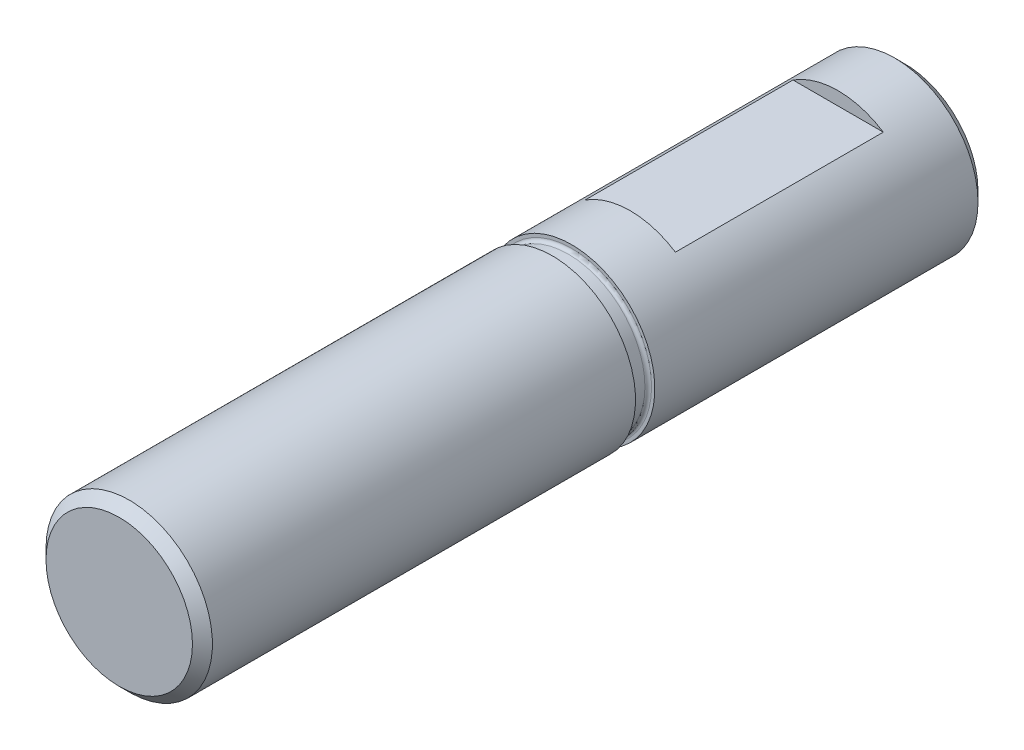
ISO-10303-21;
HEADER;
FILE_DESCRIPTION(('STEP AP214'),'2;1');
FILE_NAME('part.step','',(''),(''),'','','');
FILE_SCHEMA(('AUTOMOTIVE_DESIGN { 1 0 10303 214 1 1 1 1 }'));
ENDSEC;
DATA;
#1=APPLICATION_CONTEXT('core data for automotive mechanical design processes');
#2=APPLICATION_PROTOCOL_DEFINITION('international standard','automotive_design',2000,#1);
#3=PRODUCT_CONTEXT('',#1,'mechanical');
#4=PRODUCT('Part','Part','',(#3));
#5=PRODUCT_RELATED_PRODUCT_CATEGORY('part','',(#4));
#6=PRODUCT_DEFINITION_FORMATION('','',#4);
#7=PRODUCT_DEFINITION_CONTEXT('part definition',#1,'design');
#8=PRODUCT_DEFINITION('design','',#6,#7);
#9=PRODUCT_DEFINITION_SHAPE('','',#8);
#10=(LENGTH_UNIT() NAMED_UNIT(*) SI_UNIT(.MILLI.,.METRE.));
#11=(NAMED_UNIT(*) PLANE_ANGLE_UNIT() SI_UNIT($,.RADIAN.));
#12=(NAMED_UNIT(*) SI_UNIT($,.STERADIAN.) SOLID_ANGLE_UNIT());
#13=UNCERTAINTY_MEASURE_WITH_UNIT(LENGTH_MEASURE(1.E-05),#10,'distance_accuracy_value','');
#14=(GEOMETRIC_REPRESENTATION_CONTEXT(3) GLOBAL_UNCERTAINTY_ASSIGNED_CONTEXT((#13)) GLOBAL_UNIT_ASSIGNED_CONTEXT((#10,
#11,#12)) REPRESENTATION_CONTEXT('',''));
#15=CARTESIAN_POINT('',(0.,0.,0.));
#16=DIRECTION('',(0.,0.,1.));
#17=DIRECTION('',(1.,0.,0.));
#18=AXIS2_PLACEMENT_3D('',#15,#16,#17);
#19=CARTESIAN_POINT('',(0.,0.,29.9466));
#20=DIRECTION('',(0.,0.,-1.));
#21=DIRECTION('',(-1.,0.,0.));
#22=AXIS2_PLACEMENT_3D('',#19,#20,#21);
#23=CYLINDRICAL_SURFACE('',#22,3.17246);
#24=CARTESIAN_POINT('',(0.,0.,29.5656));
#25=DIRECTION('',(0.,0.,1.));
#26=DIRECTION('',(1.,0.,0.));
#27=AXIS2_PLACEMENT_3D('',#24,#25,#26);
#28=CIRCLE('',#27,3.17246);
#29=CARTESIAN_POINT('',(-3.17246,0.,29.5656));
#30=VERTEX_POINT('',#29);
#31=EDGE_CURVE('E83',#30,#30,#28,.F.);
#32=CARTESIAN_POINT('',(0.,0.,13.4366));
#33=DIRECTION('',(0.,0.,-1.));
#34=DIRECTION('',(-1.,0.,0.));
#35=AXIS2_PLACEMENT_3D('',#32,#33,#34);
#36=CIRCLE('',#35,3.17246);
#37=CARTESIAN_POINT('',(-3.17246,0.,13.4366));
#38=VERTEX_POINT('',#37);
#39=EDGE_CURVE('E149',#38,#38,#36,.T.);
#40=CARTESIAN_POINT('',(-3.17246,0.,29.5656));
#41=CARTESIAN_POINT('',(-3.17246,0.,29.3975895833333));
#42=CARTESIAN_POINT('',(-3.17246,0.,29.2295791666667));
#43=CARTESIAN_POINT('',(-3.17246,0.,28.8935583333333));
#44=CARTESIAN_POINT('',(-3.17246,0.,28.7255479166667));
#45=CARTESIAN_POINT('',(-3.17246,0.,28.3895270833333));
#46=CARTESIAN_POINT('',(-3.17246,0.,28.2215166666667));
#47=CARTESIAN_POINT('',(-3.17246,0.,27.8854958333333));
#48=CARTESIAN_POINT('',(-3.17246,0.,27.7174854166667));
#49=CARTESIAN_POINT('',(-3.17246,0.,27.3814645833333));
#50=CARTESIAN_POINT('',(-3.17246,0.,27.2134541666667));
#51=CARTESIAN_POINT('',(-3.17246,0.,26.8774333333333));
#52=CARTESIAN_POINT('',(-3.17246,0.,26.7094229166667));
#53=CARTESIAN_POINT('',(-3.17246,0.,26.3734020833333));
#54=CARTESIAN_POINT('',(-3.17246,0.,26.2053916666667));
#55=CARTESIAN_POINT('',(-3.17246,0.,25.8693708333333));
#56=CARTESIAN_POINT('',(-3.17246,0.,25.7013604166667));
#57=CARTESIAN_POINT('',(-3.17246,0.,25.3653395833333));
#58=CARTESIAN_POINT('',(-3.17246,0.,25.1973291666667));
#59=CARTESIAN_POINT('',(-3.17246,0.,24.8613083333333));
#60=CARTESIAN_POINT('',(-3.17246,0.,24.6932979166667));
#61=CARTESIAN_POINT('',(-3.17246,0.,24.3572770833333));
#62=CARTESIAN_POINT('',(-3.17246,0.,24.1892666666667));
#63=CARTESIAN_POINT('',(-3.17246,0.,23.8532458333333));
#64=CARTESIAN_POINT('',(-3.17246,0.,23.6852354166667));
#65=CARTESIAN_POINT('',(-3.17246,0.,23.3492145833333));
#66=CARTESIAN_POINT('',(-3.17246,0.,23.1812041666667));
#67=CARTESIAN_POINT('',(-3.17246,0.,22.8451833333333));
#68=CARTESIAN_POINT('',(-3.17246,0.,22.6771729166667));
#69=CARTESIAN_POINT('',(-3.17246,0.,22.3411520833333));
#70=CARTESIAN_POINT('',(-3.17246,0.,22.1731416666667));
#71=CARTESIAN_POINT('',(-3.17246,0.,21.8371208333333));
#72=CARTESIAN_POINT('',(-3.17246,0.,21.6691104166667));
#73=CARTESIAN_POINT('',(-3.17246,0.,21.3330895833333));
#74=CARTESIAN_POINT('',(-3.17246,0.,21.1650791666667));
#75=CARTESIAN_POINT('',(-3.17246,0.,20.8290583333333));
#76=CARTESIAN_POINT('',(-3.17246,0.,20.6610479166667));
#77=CARTESIAN_POINT('',(-3.17246,0.,20.3250270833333));
#78=CARTESIAN_POINT('',(-3.17246,0.,20.1570166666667));
#79=CARTESIAN_POINT('',(-3.17246,0.,19.8209958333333));
#80=CARTESIAN_POINT('',(-3.17246,0.,19.6529854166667));
#81=CARTESIAN_POINT('',(-3.17246,0.,19.3169645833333));
#82=CARTESIAN_POINT('',(-3.17246,0.,19.1489541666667));
#83=CARTESIAN_POINT('',(-3.17246,0.,18.8129333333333));
#84=CARTESIAN_POINT('',(-3.17246,0.,18.6449229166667));
#85=CARTESIAN_POINT('',(-3.17246,0.,18.3089020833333));
#86=CARTESIAN_POINT('',(-3.17246,0.,18.1408916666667));
#87=CARTESIAN_POINT('',(-3.17246,0.,17.8048708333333));
#88=CARTESIAN_POINT('',(-3.17246,0.,17.6368604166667));
#89=CARTESIAN_POINT('',(-3.17246,0.,17.3008395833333));
#90=CARTESIAN_POINT('',(-3.17246,0.,17.1328291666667));
#91=CARTESIAN_POINT('',(-3.17246,0.,16.7968083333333));
#92=CARTESIAN_POINT('',(-3.17246,0.,16.6287979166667));
#93=CARTESIAN_POINT('',(-3.17246,0.,16.2927770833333));
#94=CARTESIAN_POINT('',(-3.17246,0.,16.1247666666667));
#95=CARTESIAN_POINT('',(-3.17246,0.,15.7887458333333));
#96=CARTESIAN_POINT('',(-3.17246,0.,15.6207354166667));
#97=CARTESIAN_POINT('',(-3.17246,0.,15.2847145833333));
#98=CARTESIAN_POINT('',(-3.17246,0.,15.1167041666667));
#99=CARTESIAN_POINT('',(-3.17246,0.,14.7806833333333));
#100=CARTESIAN_POINT('',(-3.17246,0.,14.6126729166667));
#101=CARTESIAN_POINT('',(-3.17246,0.,14.2766520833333));
#102=CARTESIAN_POINT('',(-3.17246,0.,14.1086416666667));
#103=CARTESIAN_POINT('',(-3.17246,0.,13.7726208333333));
#104=CARTESIAN_POINT('',(-3.17246,0.,13.6046104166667));
#105=CARTESIAN_POINT('',(-3.17246,0.,13.4366));
#106=B_SPLINE_CURVE_WITH_KNOTS('',3,(#40,#41,#42,#43,#44,#45,#46,#47,#48,#49,#50,#51,#52,#53,
#54,#55,#56,#57,#58,#59,#60,#61,#62,#63,#64,#65,#66,#67,#68,#69,#70,#71,#72,#73,#74,#75,#76,#77,
#78,#79,#80,#81,#82,#83,#84,#85,#86,#87,#88,#89,#90,#91,#92,#93,#94,#95,#96,#97,#98,#99,#100,
#101,#102,#103,#104,#105),.UNSPECIFIED.,.F.,.F.,(4,2,2,2,2,2,2,2,2,2,2,2,2,2,2,2,2,2,2,2,2,2,2,
2,2,2,2,2,2,2,2,2,4),(0.,0.504031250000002,1.0080625,1.51209375,2.016125,2.52015625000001,
3.0241875,3.52821875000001,4.03225,4.53628125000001,5.04031250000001,5.54434375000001,
6.04837500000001,6.55240625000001,7.05643750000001,7.56046875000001,8.06450000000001,
8.56853125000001,9.07256250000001,9.57659375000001,10.080625,10.58465625,11.0886875,11.59271875,
12.09675,12.60078125,13.1048125,13.60884375,14.112875,14.61690625,15.1209375,15.62496875,
16.129),.UNSPECIFIED.);
#107=EDGE_CURVE('BSEAM33',#30,#38,#106,.T.);
#108=ORIENTED_EDGE('',*,*,#31,.T.);
#109=ORIENTED_EDGE('',*,*,#39,.F.);
#110=ORIENTED_EDGE('',*,*,#107,.T.);
#111=ORIENTED_EDGE('',*,*,#107,.F.);
#112=EDGE_LOOP('',(#108,#110,#109,#111));
#113=FACE_BOUND('',#112,.T.);
#114=ADVANCED_FACE('F33',(#113),#23,.T.);
#115=CARTESIAN_POINT('',(0.,0.,29.9466));
#116=DIRECTION('',(0.,0.,1.));
#117=DIRECTION('',(1.,0.,0.));
#118=AXIS2_PLACEMENT_3D('',#115,#116,#117);
#119=PLANE('',#118);
#120=CARTESIAN_POINT('',(0.,0.,29.9466));
#121=DIRECTION('',(0.,0.,1.));
#122=DIRECTION('',(1.,0.,0.));
#123=AXIS2_PLACEMENT_3D('',#120,#121,#122);
#124=CIRCLE('',#123,2.79146000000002);
#125=CARTESIAN_POINT('',(2.79146000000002,0.,29.9466));
#126=VERTEX_POINT('',#125);
#127=EDGE_CURVE('E80',#126,#126,#124,.T.);
#128=ORIENTED_EDGE('',*,*,#127,.T.);
#129=EDGE_LOOP('',(#128));
#130=FACE_BOUND('',#129,.T.);
#131=ADVANCED_FACE('F98',(#130),#119,.T.);
#132=CARTESIAN_POINT('',(3.17246,0.,13.4366));
#133=DIRECTION('',(0.,0.,-1.));
#134=DIRECTION('',(-1.,0.,0.));
#135=AXIS2_PLACEMENT_3D('',#132,#133,#134);
#136=PLANE('',#135);
#137=CARTESIAN_POINT('',(0.,0.,13.4366));
#138=DIRECTION('',(0.,0.,-1.));
#139=DIRECTION('',(-1.,0.,0.));
#140=AXIS2_PLACEMENT_3D('',#137,#138,#139);
#141=CIRCLE('',#140,3.048);
#142=CARTESIAN_POINT('',(-3.048,0.,13.4366));
#143=VERTEX_POINT('',#142);
#144=EDGE_CURVE('E65',#143,#143,#141,.F.);
#145=ORIENTED_EDGE('',*,*,#144,.T.);
#146=EDGE_LOOP('',(#145));
#147=FACE_BOUND('',#146,.T.);
#148=ORIENTED_EDGE('',*,*,#39,.T.);
#149=EDGE_LOOP('',(#148));
#150=FACE_BOUND('',#149,.T.);
#151=ADVANCED_FACE('F104',(#147,#150),#136,.T.);
#152=CARTESIAN_POINT('',(0.,0.,0.));
#153=DIRECTION('',(0.,0.,-1.));
#154=DIRECTION('',(-1.,0.,0.));
#155=AXIS2_PLACEMENT_3D('',#152,#153,#154);
#156=CYLINDRICAL_SURFACE('',#155,2.921);
#157=CARTESIAN_POINT('',(0.,0.,12.827));
#158=DIRECTION('',(0.,0.,1.));
#159=DIRECTION('',(1.,0.,0.));
#160=AXIS2_PLACEMENT_3D('',#157,#158,#159);
#161=CIRCLE('',#160,2.921);
#162=CARTESIAN_POINT('',(2.921,0.,12.827));
#163=VERTEX_POINT('',#162);
#164=EDGE_CURVE('E160',#163,#163,#161,.T.);
#165=ORIENTED_EDGE('',*,*,#164,.T.);
#166=EDGE_LOOP('',(#165));
#167=FACE_BOUND('',#166,.T.);
#168=CARTESIAN_POINT('',(0.,0.,13.3096));
#169=DIRECTION('',(0.,0.,-1.));
#170=DIRECTION('',(-1.,0.,0.));
#171=AXIS2_PLACEMENT_3D('',#168,#169,#170);
#172=CIRCLE('',#171,2.921);
#173=CARTESIAN_POINT('',(-2.921,0.,13.3096));
#174=VERTEX_POINT('',#173);
#175=EDGE_CURVE('E157',#174,#174,#172,.T.);
#176=ORIENTED_EDGE('',*,*,#175,.T.);
#177=EDGE_LOOP('',(#176));
#178=FACE_BOUND('',#177,.T.);
#179=ADVANCED_FACE('F124',(#167,#178),#156,.T.);
#180=CARTESIAN_POINT('',(3.17246,0.,12.7));
#181=DIRECTION('',(0.,0.,1.));
#182=DIRECTION('',(1.,0.,0.));
#183=AXIS2_PLACEMENT_3D('',#180,#181,#182);
#184=PLANE('',#183);
#185=CARTESIAN_POINT('',(0.,0.,12.7));
#186=DIRECTION('',(0.,0.,1.));
#187=DIRECTION('',(1.,0.,0.));
#188=AXIS2_PLACEMENT_3D('',#185,#186,#187);
#189=CIRCLE('',#188,3.048);
#190=CARTESIAN_POINT('',(3.048,0.,12.7));
#191=VERTEX_POINT('',#190);
#192=EDGE_CURVE('E154',#191,#191,#189,.F.);
#193=ORIENTED_EDGE('',*,*,#192,.T.);
#194=EDGE_LOOP('',(#193));
#195=FACE_BOUND('',#194,.T.);
#196=CARTESIAN_POINT('',(0.,0.,12.7));
#197=DIRECTION('',(0.,0.,-1.));
#198=DIRECTION('',(-1.,0.,0.));
#199=AXIS2_PLACEMENT_3D('',#196,#197,#198);
#200=CIRCLE('',#199,3.17246);
#201=CARTESIAN_POINT('',(-3.17246,0.,12.7));
#202=VERTEX_POINT('',#201);
#203=EDGE_CURVE('E146',#202,#202,#200,.T.);
#204=ORIENTED_EDGE('',*,*,#203,.F.);
#205=EDGE_LOOP('',(#204));
#206=FACE_BOUND('',#205,.T.);
#207=ADVANCED_FACE('F119',(#195,#206),#184,.T.);
#208=CARTESIAN_POINT('',(0.,0.,0.));
#209=DIRECTION('',(0.,0.,1.));
#210=DIRECTION('',(1.,0.,0.));
#211=AXIS2_PLACEMENT_3D('',#208,#209,#210);
#212=PLANE('',#211);
#213=CARTESIAN_POINT('',(0.,0.,0.));
#214=DIRECTION('',(0.,0.,1.));
#215=DIRECTION('',(1.,0.,0.));
#216=AXIS2_PLACEMENT_3D('',#213,#214,#215);
#217=CIRCLE('',#216,2.79145999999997);
#218=CARTESIAN_POINT('',(2.79145999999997,0.,0.));
#219=VERTEX_POINT('',#218);
#220=EDGE_CURVE('E11',#219,#219,#217,.F.);
#221=ORIENTED_EDGE('',*,*,#220,.T.);
#222=EDGE_LOOP('',(#221));
#223=FACE_BOUND('',#222,.T.);
#224=ADVANCED_FACE('F112',(#223),#212,.F.);
#225=CARTESIAN_POINT('',(0.,0.,0.381000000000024));
#226=DIRECTION('',(0.,0.,1.));
#227=DIRECTION('',(1.,0.,0.));
#228=AXIS2_PLACEMENT_3D('',#225,#226,#227);
#229=CIRCLE('',#228,3.17246);
#230=CARTESIAN_POINT('',(3.17246,0.,0.381000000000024));
#231=VERTEX_POINT('',#230);
#232=EDGE_CURVE('E41',#231,#231,#229,.T.);
#233=ORIENTED_EDGE('',*,*,#232,.T.);
#234=EDGE_LOOP('',(#233));
#235=FACE_BOUND('',#234,.T.);
#236=DIRECTION('',(0.,0.,-1.));
#237=VECTOR('',#236,1.);
#238=CARTESIAN_POINT('',(-1.72196264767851,2.66446,29.9466));
#239=LINE('',#238,#237);
#240=CARTESIAN_POINT('',(-1.72196264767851,2.66446,10.4648));
#241=VERTEX_POINT('',#240);
#242=CARTESIAN_POINT('',(-1.72196264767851,2.66446,2.54));
#243=VERTEX_POINT('',#242);
#244=EDGE_CURVE('E68',#241,#243,#239,.T.);
#245=ORIENTED_EDGE('',*,*,#244,.T.);
#246=CARTESIAN_POINT('',(0.,0.,2.54));
#247=DIRECTION('',(0.,0.,-1.));
#248=DIRECTION('',(-1.,0.,0.));
#249=AXIS2_PLACEMENT_3D('',#246,#247,#248);
#250=CIRCLE('',#249,3.17246);
#251=CARTESIAN_POINT('',(1.72196264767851,2.66446,2.54));
#252=VERTEX_POINT('',#251);
#253=EDGE_CURVE('E74',#243,#252,#250,.T.);
#254=ORIENTED_EDGE('',*,*,#253,.T.);
#255=DIRECTION('',(0.,0.,-1.));
#256=VECTOR('',#255,1.);
#257=CARTESIAN_POINT('',(1.72196264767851,2.66446,29.9466));
#258=LINE('',#257,#256);
#259=CARTESIAN_POINT('',(1.72196264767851,2.66446,10.4648));
#260=VERTEX_POINT('',#259);
#261=EDGE_CURVE('E54',#252,#260,#258,.F.);
#262=ORIENTED_EDGE('',*,*,#261,.T.);
#263=CARTESIAN_POINT('',(0.,0.,10.4648));
#264=DIRECTION('',(0.,0.,1.));
#265=DIRECTION('',(1.,0.,0.));
#266=AXIS2_PLACEMENT_3D('',#263,#264,#265);
#267=CIRCLE('',#266,3.17246);
#268=EDGE_CURVE('E61',#260,#241,#267,.T.);
#269=ORIENTED_EDGE('',*,*,#268,.T.);
#270=EDGE_LOOP('',(#245,#254,#262,#269));
#271=FACE_BOUND('',#270,.T.);
#272=ORIENTED_EDGE('',*,*,#203,.T.);
#273=EDGE_LOOP('',(#272));
#274=FACE_BOUND('',#273,.T.);
#275=ADVANCED_FACE('F72',(#235,#271,#274),#23,.T.);
#276=CARTESIAN_POINT('',(0.,0.,12.827));
#277=DIRECTION('',(0.,0.,1.));
#278=DIRECTION('',(1.,0.,0.));
#279=AXIS2_PLACEMENT_3D('',#276,#277,#278);
#280=TOROIDAL_SURFACE('',#279,3.048,0.127);
#281=ORIENTED_EDGE('',*,*,#164,.F.);
#282=EDGE_LOOP('',(#281));
#283=FACE_BOUND('',#282,.T.);
#284=ORIENTED_EDGE('',*,*,#192,.F.);
#285=EDGE_LOOP('',(#284));
#286=FACE_BOUND('',#285,.T.);
#287=ADVANCED_FACE('F111',(#283,#286),#280,.F.);
#288=CARTESIAN_POINT('',(0.,0.,13.3096));
#289=DIRECTION('',(0.,0.,-1.));
#290=DIRECTION('',(-1.,0.,0.));
#291=AXIS2_PLACEMENT_3D('',#288,#289,#290);
#292=TOROIDAL_SURFACE('',#291,3.048,0.127);
#293=ORIENTED_EDGE('',*,*,#144,.F.);
#294=EDGE_LOOP('',(#293));
#295=FACE_BOUND('',#294,.T.);
#296=ORIENTED_EDGE('',*,*,#175,.F.);
#297=EDGE_LOOP('',(#296));
#298=FACE_BOUND('',#297,.T.);
#299=ADVANCED_FACE('F117',(#295,#298),#292,.F.);
#300=CARTESIAN_POINT('',(-2.54,2.66446,2.54));
#301=DIRECTION('',(0.,0.,-1.));
#302=DIRECTION('',(-1.,0.,0.));
#303=AXIS2_PLACEMENT_3D('',#300,#301,#302);
#304=PLANE('',#303);
#305=DIRECTION('',(1.,0.,0.));
#306=VECTOR('',#305,1.);
#307=CARTESIAN_POINT('',(-2.54,2.66446,2.54));
#308=LINE('',#307,#306);
#309=EDGE_CURVE('E69',#243,#252,#308,.T.);
#310=ORIENTED_EDGE('',*,*,#309,.T.);
#311=ORIENTED_EDGE('',*,*,#253,.F.);
#312=EDGE_LOOP('',(#310,#311));
#313=FACE_BOUND('',#312,.T.);
#314=ADVANCED_FACE('F138',(#313),#304,.F.);
#315=CARTESIAN_POINT('',(-2.54,2.66446,10.4648));
#316=DIRECTION('',(0.,-1.,0.));
#317=DIRECTION('',(0.,0.,-1.));
#318=AXIS2_PLACEMENT_3D('',#315,#316,#317);
#319=PLANE('',#318);
#320=DIRECTION('',(1.,0.,0.));
#321=VECTOR('',#320,1.);
#322=CARTESIAN_POINT('',(-2.54,2.66446,10.4648));
#323=LINE('',#322,#321);
#324=EDGE_CURVE('E47',#241,#260,#323,.T.);
#325=ORIENTED_EDGE('',*,*,#324,.T.);
#326=ORIENTED_EDGE('',*,*,#261,.F.);
#327=ORIENTED_EDGE('',*,*,#309,.F.);
#328=ORIENTED_EDGE('',*,*,#244,.F.);
#329=EDGE_LOOP('',(#325,#326,#327,#328));
#330=FACE_BOUND('',#329,.T.);
#331=ADVANCED_FACE('F67',(#330),#319,.F.);
#332=CARTESIAN_POINT('',(-2.54,3.93446,10.4648));
#333=DIRECTION('',(0.,0.,1.));
#334=DIRECTION('',(1.,0.,0.));
#335=AXIS2_PLACEMENT_3D('',#332,#333,#334);
#336=PLANE('',#335);
#337=ORIENTED_EDGE('',*,*,#324,.F.);
#338=ORIENTED_EDGE('',*,*,#268,.F.);
#339=EDGE_LOOP('',(#337,#338));
#340=FACE_BOUND('',#339,.T.);
#341=ADVANCED_FACE('F62',(#340),#336,.F.);
#342=CARTESIAN_POINT('',(0.,0.,29.9466));
#343=DIRECTION('',(0.,0.,-1.));
#344=DIRECTION('',(-1.,0.,0.));
#345=AXIS2_PLACEMENT_3D('',#342,#343,#344);
#346=CONICAL_SURFACE('',#345,2.79146000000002,0.785398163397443);
#347=ORIENTED_EDGE('',*,*,#31,.F.);
#348=EDGE_LOOP('',(#347));
#349=FACE_BOUND('',#348,.T.);
#350=ORIENTED_EDGE('',*,*,#127,.F.);
#351=EDGE_LOOP('',(#350));
#352=FACE_BOUND('',#351,.T.);
#353=ADVANCED_FACE('F90',(#349,#352),#346,.T.);
#354=CARTESIAN_POINT('',(0.,0.,0.381000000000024));
#355=DIRECTION('',(0.,0.,1.));
#356=DIRECTION('',(1.,0.,0.));
#357=AXIS2_PLACEMENT_3D('',#354,#355,#356);
#358=CONICAL_SURFACE('',#357,3.17246,0.785398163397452);
#359=ORIENTED_EDGE('',*,*,#220,.F.);
#360=EDGE_LOOP('',(#359));
#361=FACE_BOUND('',#360,.T.);
#362=ORIENTED_EDGE('',*,*,#232,.F.);
#363=EDGE_LOOP('',(#362));
#364=FACE_BOUND('',#363,.T.);
#365=ADVANCED_FACE('F35',(#361,#364),#358,.T.);
#366=CLOSED_SHELL('',(#114,#131,#151,#179,#207,#224,#275,#287,#299,#314,#331,#341,#353,#365));
#367=MANIFOLD_SOLID_BREP('B2',#366);
#368=ADVANCED_BREP_SHAPE_REPRESENTATION('',(#18,#367),#14);
#369=SHAPE_DEFINITION_REPRESENTATION(#9,#368);
ENDSEC;
END-ISO-10303-21;
